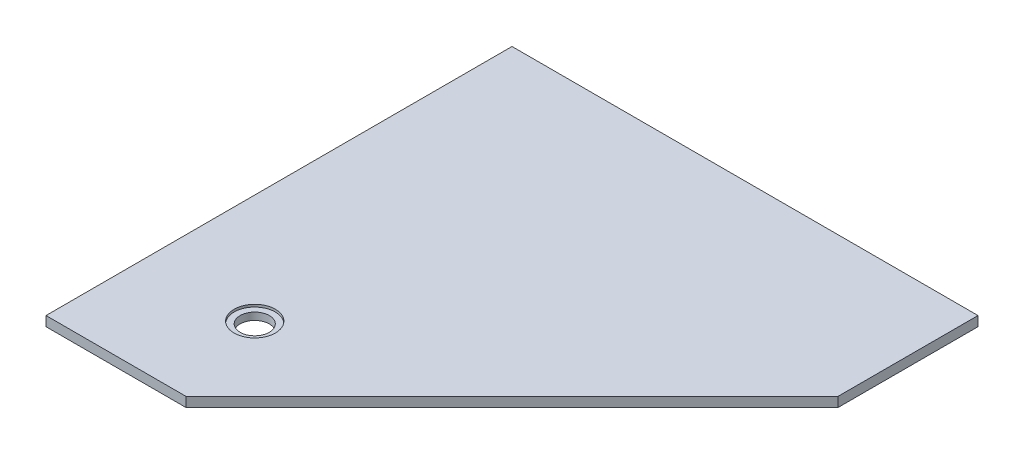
ISO-10303-21;
HEADER;
FILE_DESCRIPTION(('STEP AP214'),'2;1');
FILE_NAME('part.step','',(''),(''),'','','');
FILE_SCHEMA(('AUTOMOTIVE_DESIGN { 1 0 10303 214 1 1 1 1 }'));
ENDSEC;
DATA;
#1=APPLICATION_CONTEXT('core data for automotive mechanical design processes');
#2=APPLICATION_PROTOCOL_DEFINITION('international standard','automotive_design',2000,#1);
#3=PRODUCT_CONTEXT('',#1,'mechanical');
#4=PRODUCT('Part','Part','',(#3));
#5=PRODUCT_RELATED_PRODUCT_CATEGORY('part','',(#4));
#6=PRODUCT_DEFINITION_FORMATION('','',#4);
#7=PRODUCT_DEFINITION_CONTEXT('part definition',#1,'design');
#8=PRODUCT_DEFINITION('design','',#6,#7);
#9=PRODUCT_DEFINITION_SHAPE('','',#8);
#10=(LENGTH_UNIT() NAMED_UNIT(*) SI_UNIT(.MILLI.,.METRE.));
#11=(NAMED_UNIT(*) PLANE_ANGLE_UNIT() SI_UNIT($,.RADIAN.));
#12=(NAMED_UNIT(*) SI_UNIT($,.STERADIAN.) SOLID_ANGLE_UNIT());
#13=UNCERTAINTY_MEASURE_WITH_UNIT(LENGTH_MEASURE(1.E-05),#10,'distance_accuracy_value','');
#14=(GEOMETRIC_REPRESENTATION_CONTEXT(3) GLOBAL_UNCERTAINTY_ASSIGNED_CONTEXT((#13)) GLOBAL_UNIT_ASSIGNED_CONTEXT((#10,
#11,#12)) REPRESENTATION_CONTEXT('',''));
#15=CARTESIAN_POINT('',(0.,0.,0.));
#16=DIRECTION('',(0.,0.,1.));
#17=DIRECTION('',(1.,0.,0.));
#18=AXIS2_PLACEMENT_3D('',#15,#16,#17);
#19=CARTESIAN_POINT('',(285.75,-25.4,-260.35));
#20=DIRECTION('',(0.,1.,0.));
#21=DIRECTION('',(0.,0.,1.));
#22=AXIS2_PLACEMENT_3D('',#19,#20,#21);
#23=CYLINDRICAL_SURFACE('',#22,38.1);
#24=CARTESIAN_POINT('',(285.75,-25.4,-260.35));
#25=DIRECTION('',(0.,-1.,0.));
#26=DIRECTION('',(0.,0.,-1.));
#27=AXIS2_PLACEMENT_3D('',#24,#25,#26);
#28=CIRCLE('',#27,38.1);
#29=CARTESIAN_POINT('',(285.75,-25.4,-298.45));
#30=VERTEX_POINT('',#29);
#31=EDGE_CURVE('E113',#30,#30,#28,.T.);
#32=ORIENTED_EDGE('',*,*,#31,.T.);
#33=EDGE_LOOP('',(#32));
#34=FACE_BOUND('',#33,.T.);
#35=CARTESIAN_POINT('',(285.75,-6.35,-260.35));
#36=DIRECTION('',(0.,1.,0.));
#37=DIRECTION('',(0.,0.,1.));
#38=AXIS2_PLACEMENT_3D('',#35,#36,#37);
#39=CIRCLE('',#38,38.1);
#40=CARTESIAN_POINT('',(285.75,-6.35,-222.25));
#41=VERTEX_POINT('',#40);
#42=EDGE_CURVE('E36',#41,#41,#39,.T.);
#43=ORIENTED_EDGE('',*,*,#42,.T.);
#44=EDGE_LOOP('',(#43));
#45=FACE_BOUND('',#44,.T.);
#46=ADVANCED_FACE('F32',(#34,#45),#23,.F.);
#47=CARTESIAN_POINT('',(0.,-25.4,0.));
#48=DIRECTION('',(0.,1.,0.));
#49=DIRECTION('',(0.,0.,1.));
#50=AXIS2_PLACEMENT_3D('',#47,#48,#49);
#51=PLANE('',#50);
#52=DIRECTION('',(0.,0.,-1.));
#53=VECTOR('',#52,1.);
#54=CARTESIAN_POINT('',(0.,-25.4,-1219.2));
#55=LINE('',#54,#53);
#56=CARTESIAN_POINT('',(0.,-25.4,0.));
#57=VERTEX_POINT('',#56);
#58=CARTESIAN_POINT('',(0.,-25.4,-1219.2));
#59=VERTEX_POINT('',#58);
#60=EDGE_CURVE('E118',#57,#59,#55,.T.);
#61=ORIENTED_EDGE('',*,*,#60,.T.);
#62=DIRECTION('',(1.,0.,0.));
#63=VECTOR('',#62,1.);
#64=CARTESIAN_POINT('',(1219.2,-25.4,-1219.2));
#65=LINE('',#64,#63);
#66=CARTESIAN_POINT('',(1219.2,-25.4,-1219.2));
#67=VERTEX_POINT('',#66);
#68=EDGE_CURVE('E84',#59,#67,#65,.T.);
#69=ORIENTED_EDGE('',*,*,#68,.T.);
#70=DIRECTION('',(0.,0.,1.));
#71=VECTOR('',#70,1.);
#72=CARTESIAN_POINT('',(1219.2,-25.4,-853.078975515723));
#73=LINE('',#72,#71);
#74=CARTESIAN_POINT('',(1219.2,-25.4,-853.078975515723));
#75=VERTEX_POINT('',#74);
#76=EDGE_CURVE('E88',#67,#75,#73,.T.);
#77=ORIENTED_EDGE('',*,*,#76,.T.);
#78=DIRECTION('',(-0.707106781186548,0.,0.707106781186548));
#79=VECTOR('',#78,1.);
#80=CARTESIAN_POINT('',(366.121024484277,-25.4,0.));
#81=LINE('',#80,#79);
#82=CARTESIAN_POINT('',(366.121024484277,-25.4,0.));
#83=VERTEX_POINT('',#82);
#84=EDGE_CURVE('E93',#75,#83,#81,.T.);
#85=ORIENTED_EDGE('',*,*,#84,.T.);
#86=DIRECTION('',(-1.,0.,0.));
#87=VECTOR('',#86,1.);
#88=CARTESIAN_POINT('',(0.,-25.4,0.));
#89=LINE('',#88,#87);
#90=EDGE_CURVE('E50',#83,#57,#89,.T.);
#91=ORIENTED_EDGE('',*,*,#90,.T.);
#92=EDGE_LOOP('',(#61,#69,#77,#85,#91));
#93=FACE_BOUND('',#92,.T.);
#94=ORIENTED_EDGE('',*,*,#31,.F.);
#95=EDGE_LOOP('',(#94));
#96=FACE_BOUND('',#95,.T.);
#97=ADVANCED_FACE('F90',(#93,#96),#51,.F.);
#98=CARTESIAN_POINT('',(0.,0.,0.));
#99=DIRECTION('',(0.,1.,0.));
#100=DIRECTION('',(0.,0.,1.));
#101=AXIS2_PLACEMENT_3D('',#98,#99,#100);
#102=PLANE('',#101);
#103=CARTESIAN_POINT('',(285.75,0.,-260.35));
#104=DIRECTION('',(0.,1.,0.));
#105=DIRECTION('',(0.,0.,1.));
#106=AXIS2_PLACEMENT_3D('',#103,#104,#105);
#107=CIRCLE('',#106,53.975);
#108=CARTESIAN_POINT('',(285.75,0.,-206.375));
#109=VERTEX_POINT('',#108);
#110=EDGE_CURVE('E158',#109,#109,#107,.T.);
#111=ORIENTED_EDGE('',*,*,#110,.F.);
#112=EDGE_LOOP('',(#111));
#113=FACE_BOUND('',#112,.T.);
#114=DIRECTION('',(0.,0.,-1.));
#115=VECTOR('',#114,1.);
#116=CARTESIAN_POINT('',(0.,0.,-1219.2));
#117=LINE('',#116,#115);
#118=CARTESIAN_POINT('',(0.,0.,0.));
#119=VERTEX_POINT('',#118);
#120=CARTESIAN_POINT('',(0.,0.,-1219.2));
#121=VERTEX_POINT('',#120);
#122=EDGE_CURVE('E109',#119,#121,#117,.T.);
#123=ORIENTED_EDGE('',*,*,#122,.F.);
#124=DIRECTION('',(-1.,0.,0.));
#125=VECTOR('',#124,1.);
#126=CARTESIAN_POINT('',(0.,0.,0.));
#127=LINE('',#126,#125);
#128=CARTESIAN_POINT('',(366.121024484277,0.,0.));
#129=VERTEX_POINT('',#128);
#130=EDGE_CURVE('E76',#129,#119,#127,.T.);
#131=ORIENTED_EDGE('',*,*,#130,.F.);
#132=DIRECTION('',(-0.707106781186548,0.,0.707106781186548));
#133=VECTOR('',#132,1.);
#134=CARTESIAN_POINT('',(366.121024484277,0.,0.));
#135=LINE('',#134,#133);
#136=CARTESIAN_POINT('',(1219.2,0.,-853.078975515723));
#137=VERTEX_POINT('',#136);
#138=EDGE_CURVE('E70',#137,#129,#135,.T.);
#139=ORIENTED_EDGE('',*,*,#138,.F.);
#140=DIRECTION('',(0.,0.,1.));
#141=VECTOR('',#140,1.);
#142=CARTESIAN_POINT('',(1219.2,0.,-853.078975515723));
#143=LINE('',#142,#141);
#144=CARTESIAN_POINT('',(1219.2,0.,-1219.2));
#145=VERTEX_POINT('',#144);
#146=EDGE_CURVE('E100',#145,#137,#143,.T.);
#147=ORIENTED_EDGE('',*,*,#146,.F.);
#148=DIRECTION('',(1.,0.,0.));
#149=VECTOR('',#148,1.);
#150=CARTESIAN_POINT('',(1219.2,0.,-1219.2));
#151=LINE('',#150,#149);
#152=EDGE_CURVE('E112',#121,#145,#151,.T.);
#153=ORIENTED_EDGE('',*,*,#152,.F.);
#154=EDGE_LOOP('',(#123,#131,#139,#147,#153));
#155=FACE_BOUND('',#154,.T.);
#156=ADVANCED_FACE('F123',(#113,#155),#102,.T.);
#157=CARTESIAN_POINT('',(0.,-25.4,-1219.2));
#158=DIRECTION('',(1.,0.,0.));
#159=DIRECTION('',(0.,0.,-1.));
#160=AXIS2_PLACEMENT_3D('',#157,#158,#159);
#161=PLANE('',#160);
#162=ORIENTED_EDGE('',*,*,#122,.T.);
#163=DIRECTION('',(0.,1.,0.));
#164=VECTOR('',#163,1.);
#165=CARTESIAN_POINT('',(0.,-25.4,-1219.2));
#166=LINE('',#165,#164);
#167=EDGE_CURVE('E11',#59,#121,#166,.T.);
#168=ORIENTED_EDGE('',*,*,#167,.F.);
#169=ORIENTED_EDGE('',*,*,#60,.F.);
#170=DIRECTION('',(0.,1.,0.));
#171=VECTOR('',#170,1.);
#172=CARTESIAN_POINT('',(0.,-25.4,0.));
#173=LINE('',#172,#171);
#174=EDGE_CURVE('E105',#57,#119,#173,.T.);
#175=ORIENTED_EDGE('',*,*,#174,.T.);
#176=EDGE_LOOP('',(#162,#168,#169,#175));
#177=FACE_BOUND('',#176,.T.);
#178=ADVANCED_FACE('F34',(#177),#161,.F.);
#179=CARTESIAN_POINT('',(1219.2,-25.4,-1219.2));
#180=DIRECTION('',(0.,0.,1.));
#181=DIRECTION('',(1.,0.,0.));
#182=AXIS2_PLACEMENT_3D('',#179,#180,#181);
#183=PLANE('',#182);
#184=ORIENTED_EDGE('',*,*,#152,.T.);
#185=DIRECTION('',(0.,1.,0.));
#186=VECTOR('',#185,1.);
#187=CARTESIAN_POINT('',(1219.2,-25.4,-1219.2));
#188=LINE('',#187,#186);
#189=EDGE_CURVE('E42',#67,#145,#188,.T.);
#190=ORIENTED_EDGE('',*,*,#189,.F.);
#191=ORIENTED_EDGE('',*,*,#68,.F.);
#192=ORIENTED_EDGE('',*,*,#167,.T.);
#193=EDGE_LOOP('',(#184,#190,#191,#192));
#194=FACE_BOUND('',#193,.T.);
#195=ADVANCED_FACE('F155',(#194),#183,.F.);
#196=CARTESIAN_POINT('',(1219.2,-25.4,-853.078975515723));
#197=DIRECTION('',(-1.,0.,0.));
#198=DIRECTION('',(0.,0.,1.));
#199=AXIS2_PLACEMENT_3D('',#196,#197,#198);
#200=PLANE('',#199);
#201=ORIENTED_EDGE('',*,*,#146,.T.);
#202=DIRECTION('',(0.,1.,0.));
#203=VECTOR('',#202,1.);
#204=CARTESIAN_POINT('',(1219.2,-25.4,-853.078975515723));
#205=LINE('',#204,#203);
#206=EDGE_CURVE('E97',#75,#137,#205,.T.);
#207=ORIENTED_EDGE('',*,*,#206,.F.);
#208=ORIENTED_EDGE('',*,*,#76,.F.);
#209=ORIENTED_EDGE('',*,*,#189,.T.);
#210=EDGE_LOOP('',(#201,#207,#208,#209));
#211=FACE_BOUND('',#210,.T.);
#212=ADVANCED_FACE('F98',(#211),#200,.F.);
#213=CARTESIAN_POINT('',(366.121024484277,-25.4,0.));
#214=DIRECTION('',(-0.707106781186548,0.,-0.707106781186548));
#215=DIRECTION('',(-0.707106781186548,0.,0.707106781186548));
#216=AXIS2_PLACEMENT_3D('',#213,#214,#215);
#217=PLANE('',#216);
#218=ORIENTED_EDGE('',*,*,#138,.T.);
#219=DIRECTION('',(0.,1.,0.));
#220=VECTOR('',#219,1.);
#221=CARTESIAN_POINT('',(366.121024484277,-25.4,0.));
#222=LINE('',#221,#220);
#223=EDGE_CURVE('E101',#83,#129,#222,.T.);
#224=ORIENTED_EDGE('',*,*,#223,.F.);
#225=ORIENTED_EDGE('',*,*,#84,.F.);
#226=ORIENTED_EDGE('',*,*,#206,.T.);
#227=EDGE_LOOP('',(#218,#224,#225,#226));
#228=FACE_BOUND('',#227,.T.);
#229=ADVANCED_FACE('F103',(#228),#217,.F.);
#230=CARTESIAN_POINT('',(0.,-25.4,0.));
#231=DIRECTION('',(0.,0.,-1.));
#232=DIRECTION('',(-1.,0.,0.));
#233=AXIS2_PLACEMENT_3D('',#230,#231,#232);
#234=PLANE('',#233);
#235=ORIENTED_EDGE('',*,*,#130,.T.);
#236=ORIENTED_EDGE('',*,*,#174,.F.);
#237=ORIENTED_EDGE('',*,*,#90,.F.);
#238=ORIENTED_EDGE('',*,*,#223,.T.);
#239=EDGE_LOOP('',(#235,#236,#237,#238));
#240=FACE_BOUND('',#239,.T.);
#241=ADVANCED_FACE('F127',(#240),#234,.F.);
#242=CARTESIAN_POINT('',(285.75,-6.35,-260.35));
#243=DIRECTION('',(0.,1.,0.));
#244=DIRECTION('',(0.,0.,1.));
#245=AXIS2_PLACEMENT_3D('',#242,#243,#244);
#246=CYLINDRICAL_SURFACE('',#245,53.975);
#247=CARTESIAN_POINT('',(285.75,-6.35,-260.35));
#248=DIRECTION('',(0.,1.,0.));
#249=DIRECTION('',(0.,0.,1.));
#250=AXIS2_PLACEMENT_3D('',#247,#248,#249);
#251=CIRCLE('',#250,53.975);
#252=CARTESIAN_POINT('',(285.75,-6.35,-206.375));
#253=VERTEX_POINT('',#252);
#254=EDGE_CURVE('E160',#253,#253,#251,.T.);
#255=ORIENTED_EDGE('',*,*,#254,.F.);
#256=EDGE_LOOP('',(#255));
#257=FACE_BOUND('',#256,.T.);
#258=ORIENTED_EDGE('',*,*,#110,.T.);
#259=EDGE_LOOP('',(#258));
#260=FACE_BOUND('',#259,.T.);
#261=ADVANCED_FACE('F129',(#257,#260),#246,.F.);
#262=CARTESIAN_POINT('',(285.75,-6.35,-260.35));
#263=DIRECTION('',(0.,1.,0.));
#264=DIRECTION('',(0.,0.,1.));
#265=AXIS2_PLACEMENT_3D('',#262,#263,#264);
#266=PLANE('',#265);
#267=ORIENTED_EDGE('',*,*,#42,.F.);
#268=EDGE_LOOP('',(#267));
#269=FACE_BOUND('',#268,.T.);
#270=ORIENTED_EDGE('',*,*,#254,.T.);
#271=EDGE_LOOP('',(#270));
#272=FACE_BOUND('',#271,.T.);
#273=ADVANCED_FACE('F135',(#269,#272),#266,.T.);
#274=CLOSED_SHELL('',(#46,#97,#156,#178,#195,#212,#229,#241,#261,#273));
#275=MANIFOLD_SOLID_BREP('B2',#274);
#276=ADVANCED_BREP_SHAPE_REPRESENTATION('',(#18,#275),#14);
#277=SHAPE_DEFINITION_REPRESENTATION(#9,#276);
ENDSEC;
END-ISO-10303-21;
